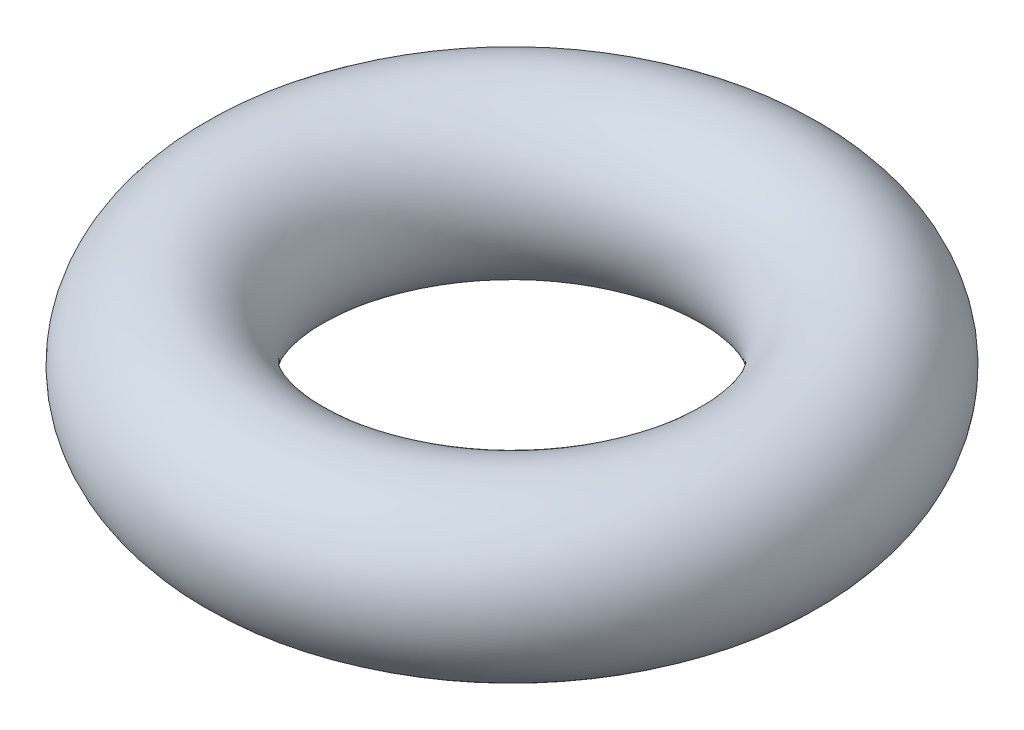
from build123d import *

# Parameters (mm, degrees)
SKETCH1_R = 0.5


with BuildPart() as part:
    # Sketch1 → Revolve1 (revolve)
    with BuildSketch(Plane.XY, mode=Mode.PRIVATE) as revolve1_sk:
        with Locations((-1.5, 0)):
            Circle(SKETCH1_R)
    revolve(revolve1_sk.sketch.rotate(Axis((0, 0, 0), (0, 1, 0)), 270), axis=Axis((0, 0, 0), (0, 1, 0)))


solid = part.part
